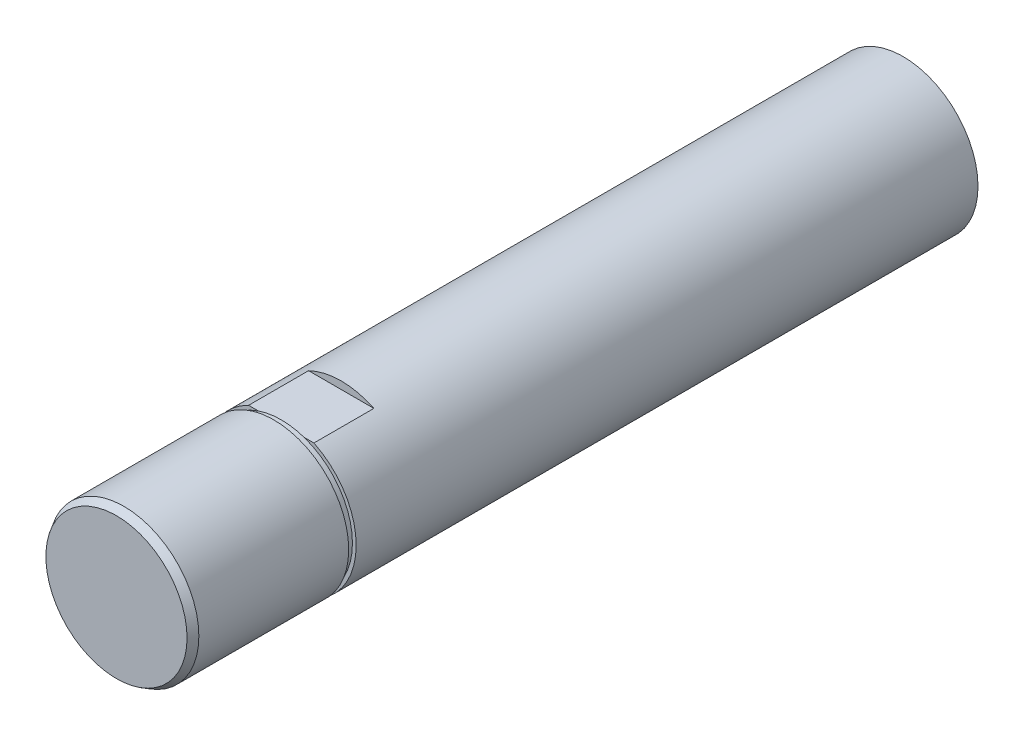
ISO-10303-21;
HEADER;
FILE_DESCRIPTION(('STEP AP214'),'2;1');
FILE_NAME('part.step','',(''),(''),'','','');
FILE_SCHEMA(('AUTOMOTIVE_DESIGN { 1 0 10303 214 1 1 1 1 }'));
ENDSEC;
DATA;
#1=APPLICATION_CONTEXT('core data for automotive mechanical design processes');
#2=APPLICATION_PROTOCOL_DEFINITION('international standard','automotive_design',2000,#1);
#3=PRODUCT_CONTEXT('',#1,'mechanical');
#4=PRODUCT('Part','Part','',(#3));
#5=PRODUCT_RELATED_PRODUCT_CATEGORY('part','',(#4));
#6=PRODUCT_DEFINITION_FORMATION('','',#4);
#7=PRODUCT_DEFINITION_CONTEXT('part definition',#1,'design');
#8=PRODUCT_DEFINITION('design','',#6,#7);
#9=PRODUCT_DEFINITION_SHAPE('','',#8);
#10=(LENGTH_UNIT() NAMED_UNIT(*) SI_UNIT(.MILLI.,.METRE.));
#11=(NAMED_UNIT(*) PLANE_ANGLE_UNIT() SI_UNIT($,.RADIAN.));
#12=(NAMED_UNIT(*) SI_UNIT($,.STERADIAN.) SOLID_ANGLE_UNIT());
#13=UNCERTAINTY_MEASURE_WITH_UNIT(LENGTH_MEASURE(1.E-05),#10,'distance_accuracy_value','');
#14=(GEOMETRIC_REPRESENTATION_CONTEXT(3) GLOBAL_UNCERTAINTY_ASSIGNED_CONTEXT((#13)) GLOBAL_UNIT_ASSIGNED_CONTEXT((#10,
#11,#12)) REPRESENTATION_CONTEXT('',''));
#15=CARTESIAN_POINT('',(0.,0.,0.));
#16=DIRECTION('',(0.,0.,1.));
#17=DIRECTION('',(1.,0.,0.));
#18=AXIS2_PLACEMENT_3D('',#15,#16,#17);
#19=CARTESIAN_POINT('',(0.,0.,8.));
#20=DIRECTION('',(0.,0.,1.));
#21=DIRECTION('',(1.,0.,0.));
#22=AXIS2_PLACEMENT_3D('',#19,#20,#21);
#23=PLANE('',#22);
#24=DIRECTION('',(1.,0.,0.));
#25=VECTOR('',#24,1.);
#26=CARTESIAN_POINT('',(-10.5,-9.,8.));
#27=LINE('',#26,#25);
#28=CARTESIAN_POINT('',(3.04138126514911,-9.,8.));
#29=VERTEX_POINT('',#28);
#30=CARTESIAN_POINT('',(4.35889894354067,-9.,7.99999999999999));
#31=VERTEX_POINT('',#30);
#32=EDGE_CURVE('E98',#29,#31,#27,.T.);
#33=ORIENTED_EDGE('',*,*,#32,.T.);
#34=CARTESIAN_POINT('',(0.,0.,8.));
#35=DIRECTION('',(0.,0.,1.));
#36=DIRECTION('',(1.,0.,0.));
#37=AXIS2_PLACEMENT_3D('',#34,#35,#36);
#38=CIRCLE('',#37,10.);
#39=CARTESIAN_POINT('',(4.35889894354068,9.,8.));
#40=VERTEX_POINT('',#39);
#41=EDGE_CURVE('E112',#31,#40,#38,.T.);
#42=ORIENTED_EDGE('',*,*,#41,.T.);
#43=DIRECTION('',(1.,0.,0.));
#44=VECTOR('',#43,1.);
#45=CARTESIAN_POINT('',(-10.5,9.,8.));
#46=LINE('',#45,#44);
#47=CARTESIAN_POINT('',(3.04138126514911,9.,8.));
#48=VERTEX_POINT('',#47);
#49=EDGE_CURVE('E146',#48,#40,#46,.T.);
#50=ORIENTED_EDGE('',*,*,#49,.F.);
#51=CARTESIAN_POINT('',(0.,0.,8.));
#52=DIRECTION('',(0.,0.,1.));
#53=DIRECTION('',(1.,0.,0.));
#54=AXIS2_PLACEMENT_3D('',#51,#52,#53);
#55=CIRCLE('',#54,9.5);
#56=EDGE_CURVE('E140',#29,#48,#55,.T.);
#57=ORIENTED_EDGE('',*,*,#56,.F.);
#58=EDGE_LOOP('',(#33,#42,#50,#57));
#59=FACE_BOUND('',#58,.T.);
#60=ADVANCED_FACE('F35',(#59),#23,.T.);
#61=CARTESIAN_POINT('',(0.,0.,-75.));
#62=DIRECTION('',(0.,0.,1.));
#63=DIRECTION('',(1.,0.,0.));
#64=AXIS2_PLACEMENT_3D('',#61,#62,#63);
#65=CYLINDRICAL_SURFACE('',#64,10.);
#66=CARTESIAN_POINT('',(0.,0.,9.));
#67=DIRECTION('',(0.,0.,1.));
#68=DIRECTION('',(1.,0.,0.));
#69=AXIS2_PLACEMENT_3D('',#66,#67,#68);
#70=CIRCLE('',#69,10.);
#71=CARTESIAN_POINT('',(10.,0.,9.));
#72=VERTEX_POINT('',#71);
#73=EDGE_CURVE('E111',#72,#72,#70,.T.);
#74=ORIENTED_EDGE('',*,*,#73,.T.);
#75=EDGE_LOOP('',(#74));
#76=FACE_BOUND('',#75,.T.);
#77=CARTESIAN_POINT('',(0.,0.,29.));
#78=DIRECTION('',(0.,0.,1.));
#79=DIRECTION('',(1.,0.,0.));
#80=AXIS2_PLACEMENT_3D('',#77,#78,#79);
#81=CIRCLE('',#80,10.);
#82=CARTESIAN_POINT('',(10.,0.,29.));
#83=VERTEX_POINT('',#82);
#84=EDGE_CURVE('E125',#83,#83,#81,.F.);
#85=ORIENTED_EDGE('',*,*,#84,.T.);
#86=EDGE_LOOP('',(#85));
#87=FACE_BOUND('',#86,.T.);
#88=ADVANCED_FACE('F176',(#76,#87),#65,.T.);
#89=CARTESIAN_POINT('',(0.,0.,30.));
#90=DIRECTION('',(0.,0.,1.));
#91=DIRECTION('',(1.,0.,0.));
#92=AXIS2_PLACEMENT_3D('',#89,#90,#91);
#93=PLANE('',#92);
#94=CARTESIAN_POINT('',(0.,0.,30.));
#95=DIRECTION('',(0.,0.,1.));
#96=DIRECTION('',(1.,0.,0.));
#97=AXIS2_PLACEMENT_3D('',#94,#95,#96);
#98=CIRCLE('',#97,9.42264973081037);
#99=CARTESIAN_POINT('',(9.42264973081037,0.,30.));
#100=VERTEX_POINT('',#99);
#101=EDGE_CURVE('E122',#100,#100,#98,.T.);
#102=ORIENTED_EDGE('',*,*,#101,.T.);
#103=EDGE_LOOP('',(#102));
#104=FACE_BOUND('',#103,.T.);
#105=ADVANCED_FACE('F181',(#104),#93,.T.);
#106=CARTESIAN_POINT('',(0.,0.,30.));
#107=DIRECTION('',(0.,0.,-1.));
#108=DIRECTION('',(-1.,0.,0.));
#109=AXIS2_PLACEMENT_3D('',#106,#107,#108);
#110=CONICAL_SURFACE('',#109,9.42264973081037,0.523598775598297);
#111=ORIENTED_EDGE('',*,*,#84,.F.);
#112=EDGE_LOOP('',(#111));
#113=FACE_BOUND('',#112,.T.);
#114=ORIENTED_EDGE('',*,*,#101,.F.);
#115=EDGE_LOOP('',(#114));
#116=FACE_BOUND('',#115,.T.);
#117=ADVANCED_FACE('F37',(#113,#116),#110,.T.);
#118=CARTESIAN_POINT('',(0.,0.,9.));
#119=DIRECTION('',(0.,0.,1.));
#120=DIRECTION('',(1.,0.,0.));
#121=AXIS2_PLACEMENT_3D('',#118,#119,#120);
#122=PLANE('',#121);
#123=ORIENTED_EDGE('',*,*,#73,.F.);
#124=EDGE_LOOP('',(#123));
#125=FACE_BOUND('',#124,.T.);
#126=CARTESIAN_POINT('',(0.,0.,9.));
#127=DIRECTION('',(0.,0.,1.));
#128=DIRECTION('',(1.,0.,0.));
#129=AXIS2_PLACEMENT_3D('',#126,#127,#128);
#130=CIRCLE('',#129,9.5);
#131=CARTESIAN_POINT('',(9.5,0.,9.));
#132=VERTEX_POINT('',#131);
#133=EDGE_CURVE('E117',#132,#132,#130,.T.);
#134=ORIENTED_EDGE('',*,*,#133,.T.);
#135=EDGE_LOOP('',(#134));
#136=FACE_BOUND('',#135,.T.);
#137=ADVANCED_FACE('F186',(#125,#136),#122,.F.);
#138=CARTESIAN_POINT('',(-4.35889894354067,-9.,7.99999999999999));
#139=VERTEX_POINT('',#138);
#140=CARTESIAN_POINT('',(-3.04138126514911,-9.,8.));
#141=VERTEX_POINT('',#140);
#142=EDGE_CURVE('E87',#139,#141,#27,.T.);
#143=ORIENTED_EDGE('',*,*,#142,.T.);
#144=CARTESIAN_POINT('',(-3.04138126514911,9.,8.));
#145=VERTEX_POINT('',#144);
#146=EDGE_CURVE('E150',#145,#141,#55,.T.);
#147=ORIENTED_EDGE('',*,*,#146,.F.);
#148=CARTESIAN_POINT('',(-4.35889894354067,9.,8.));
#149=VERTEX_POINT('',#148);
#150=EDGE_CURVE('E110',#149,#145,#46,.T.);
#151=ORIENTED_EDGE('',*,*,#150,.F.);
#152=EDGE_CURVE('E104',#149,#139,#38,.T.);
#153=ORIENTED_EDGE('',*,*,#152,.T.);
#154=EDGE_LOOP('',(#143,#147,#151,#153));
#155=FACE_BOUND('',#154,.T.);
#156=ADVANCED_FACE('F108',(#155),#23,.T.);
#157=CARTESIAN_POINT('',(0.,0.,9.));
#158=DIRECTION('',(0.,0.,-1.));
#159=DIRECTION('',(-1.,0.,0.));
#160=AXIS2_PLACEMENT_3D('',#157,#158,#159);
#161=CYLINDRICAL_SURFACE('',#160,9.5);
#162=ORIENTED_EDGE('',*,*,#133,.F.);
#163=EDGE_LOOP('',(#162));
#164=FACE_BOUND('',#163,.T.);
#165=EDGE_CURVE('E151',#48,#145,#55,.T.);
#166=ORIENTED_EDGE('',*,*,#165,.T.);
#167=ORIENTED_EDGE('',*,*,#146,.T.);
#168=CARTESIAN_POINT('',(0.,0.,8.));
#169=DIRECTION('',(0.,0.,1.));
#170=DIRECTION('',(1.,0.,0.));
#171=AXIS2_PLACEMENT_3D('',#168,#169,#170);
#172=CIRCLE('',#171,9.5);
#173=EDGE_CURVE('E155',#141,#29,#172,.T.);
#174=ORIENTED_EDGE('',*,*,#173,.T.);
#175=ORIENTED_EDGE('',*,*,#56,.T.);
#176=EDGE_LOOP('',(#166,#167,#174,#175));
#177=FACE_BOUND('',#176,.T.);
#178=ADVANCED_FACE('F161',(#164,#177),#161,.T.);
#179=CARTESIAN_POINT('',(0.,0.,-75.));
#180=DIRECTION('',(0.,0.,1.));
#181=DIRECTION('',(1.,0.,0.));
#182=AXIS2_PLACEMENT_3D('',#179,#180,#181);
#183=PLANE('',#182);
#184=CARTESIAN_POINT('',(0.,0.,-75.));
#185=DIRECTION('',(0.,0.,1.));
#186=DIRECTION('',(1.,0.,0.));
#187=AXIS2_PLACEMENT_3D('',#184,#185,#186);
#188=CIRCLE('',#187,10.);
#189=CARTESIAN_POINT('',(10.,0.,-75.));
#190=VERTEX_POINT('',#189);
#191=EDGE_CURVE('E115',#190,#190,#188,.T.);
#192=ORIENTED_EDGE('',*,*,#191,.F.);
#193=EDGE_LOOP('',(#192));
#194=FACE_BOUND('',#193,.T.);
#195=ADVANCED_FACE('F191',(#194),#183,.F.);
#196=DIRECTION('',(0.,0.,1.));
#197=VECTOR('',#196,1.);
#198=CARTESIAN_POINT('',(-4.35889894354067,-9.,-75.));
#199=LINE('',#198,#197);
#200=CARTESIAN_POINT('',(-4.35889894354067,-9.,0.));
#201=VERTEX_POINT('',#200);
#202=EDGE_CURVE('E11',#139,#201,#199,.F.);
#203=ORIENTED_EDGE('',*,*,#202,.F.);
#204=ORIENTED_EDGE('',*,*,#152,.F.);
#205=DIRECTION('',(0.,0.,1.));
#206=VECTOR('',#205,1.);
#207=CARTESIAN_POINT('',(-4.35889894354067,9.,-75.));
#208=LINE('',#207,#206);
#209=CARTESIAN_POINT('',(-4.35889894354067,9.,0.));
#210=VERTEX_POINT('',#209);
#211=EDGE_CURVE('E128',#210,#149,#208,.T.);
#212=ORIENTED_EDGE('',*,*,#211,.F.);
#213=CARTESIAN_POINT('',(0.,0.,0.));
#214=DIRECTION('',(0.,0.,-1.));
#215=DIRECTION('',(-1.,0.,0.));
#216=AXIS2_PLACEMENT_3D('',#213,#214,#215);
#217=CIRCLE('',#216,10.);
#218=CARTESIAN_POINT('',(4.35889894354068,9.,0.));
#219=VERTEX_POINT('',#218);
#220=EDGE_CURVE('E130',#219,#210,#217,.F.);
#221=ORIENTED_EDGE('',*,*,#220,.F.);
#222=DIRECTION('',(0.,0.,1.));
#223=VECTOR('',#222,1.);
#224=CARTESIAN_POINT('',(4.35889894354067,9.,-75.));
#225=LINE('',#224,#223);
#226=EDGE_CURVE('E132',#40,#219,#225,.F.);
#227=ORIENTED_EDGE('',*,*,#226,.F.);
#228=ORIENTED_EDGE('',*,*,#41,.F.);
#229=DIRECTION('',(0.,0.,1.));
#230=VECTOR('',#229,1.);
#231=CARTESIAN_POINT('',(4.35889894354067,-9.,-75.));
#232=LINE('',#231,#230);
#233=CARTESIAN_POINT('',(4.35889894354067,-9.,0.));
#234=VERTEX_POINT('',#233);
#235=EDGE_CURVE('E43',#234,#31,#232,.T.);
#236=ORIENTED_EDGE('',*,*,#235,.F.);
#237=CARTESIAN_POINT('',(0.,0.,0.));
#238=DIRECTION('',(0.,0.,-1.));
#239=DIRECTION('',(-1.,0.,0.));
#240=AXIS2_PLACEMENT_3D('',#237,#238,#239);
#241=CIRCLE('',#240,10.);
#242=EDGE_CURVE('E106',#201,#234,#241,.F.);
#243=ORIENTED_EDGE('',*,*,#242,.F.);
#244=EDGE_LOOP('',(#203,#204,#212,#221,#227,#228,#236,#243));
#245=FACE_BOUND('',#244,.T.);
#246=ORIENTED_EDGE('',*,*,#191,.T.);
#247=EDGE_LOOP('',(#246));
#248=FACE_BOUND('',#247,.T.);
#249=ADVANCED_FACE('F101',(#245,#248),#65,.T.);
#250=CARTESIAN_POINT('',(-10.5,10.5,8.));
#251=DIRECTION('',(0.,0.,1.));
#252=DIRECTION('',(1.,0.,0.));
#253=AXIS2_PLACEMENT_3D('',#250,#251,#252);
#254=PLANE('',#253);
#255=EDGE_CURVE('E152',#145,#48,#46,.T.);
#256=ORIENTED_EDGE('',*,*,#255,.F.);
#257=ORIENTED_EDGE('',*,*,#165,.F.);
#258=EDGE_LOOP('',(#256,#257));
#259=FACE_BOUND('',#258,.T.);
#260=ADVANCED_FACE('F202',(#259),#254,.F.);
#261=CARTESIAN_POINT('',(-10.5,10.5,0.));
#262=DIRECTION('',(0.,0.,-1.));
#263=DIRECTION('',(-1.,0.,0.));
#264=AXIS2_PLACEMENT_3D('',#261,#262,#263);
#265=PLANE('',#264);
#266=ORIENTED_EDGE('',*,*,#220,.T.);
#267=DIRECTION('',(1.,0.,0.));
#268=VECTOR('',#267,1.);
#269=CARTESIAN_POINT('',(-10.5,9.,0.));
#270=LINE('',#269,#268);
#271=EDGE_CURVE('E56',#210,#219,#270,.T.);
#272=ORIENTED_EDGE('',*,*,#271,.T.);
#273=EDGE_LOOP('',(#266,#272));
#274=FACE_BOUND('',#273,.T.);
#275=ADVANCED_FACE('F148',(#274),#265,.F.);
#276=CARTESIAN_POINT('',(-10.5,9.,8.));
#277=DIRECTION('',(0.,-1.,0.));
#278=DIRECTION('',(0.,0.,-1.));
#279=AXIS2_PLACEMENT_3D('',#276,#277,#278);
#280=PLANE('',#279);
#281=ORIENTED_EDGE('',*,*,#226,.T.);
#282=ORIENTED_EDGE('',*,*,#271,.F.);
#283=ORIENTED_EDGE('',*,*,#211,.T.);
#284=ORIENTED_EDGE('',*,*,#150,.T.);
#285=ORIENTED_EDGE('',*,*,#255,.T.);
#286=ORIENTED_EDGE('',*,*,#49,.T.);
#287=EDGE_LOOP('',(#281,#282,#283,#284,#285,#286));
#288=FACE_BOUND('',#287,.T.);
#289=ADVANCED_FACE('F144',(#288),#280,.F.);
#290=CARTESIAN_POINT('',(-10.5,-9.,8.));
#291=DIRECTION('',(0.,0.,1.));
#292=DIRECTION('',(1.,0.,0.));
#293=AXIS2_PLACEMENT_3D('',#290,#291,#292);
#294=PLANE('',#293);
#295=EDGE_CURVE('E92',#141,#29,#27,.T.);
#296=ORIENTED_EDGE('',*,*,#295,.T.);
#297=ORIENTED_EDGE('',*,*,#173,.F.);
#298=EDGE_LOOP('',(#296,#297));
#299=FACE_BOUND('',#298,.T.);
#300=ADVANCED_FACE('F164',(#299),#294,.F.);
#301=CARTESIAN_POINT('',(-10.5,-9.,8.));
#302=DIRECTION('',(0.,1.,0.));
#303=DIRECTION('',(0.,0.,1.));
#304=AXIS2_PLACEMENT_3D('',#301,#302,#303);
#305=PLANE('',#304);
#306=ORIENTED_EDGE('',*,*,#202,.T.);
#307=DIRECTION('',(1.,0.,0.));
#308=VECTOR('',#307,1.);
#309=CARTESIAN_POINT('',(-10.5,-9.,0.));
#310=LINE('',#309,#308);
#311=EDGE_CURVE('E49',#201,#234,#310,.T.);
#312=ORIENTED_EDGE('',*,*,#311,.T.);
#313=ORIENTED_EDGE('',*,*,#235,.T.);
#314=ORIENTED_EDGE('',*,*,#32,.F.);
#315=ORIENTED_EDGE('',*,*,#295,.F.);
#316=ORIENTED_EDGE('',*,*,#142,.F.);
#317=EDGE_LOOP('',(#306,#312,#313,#314,#315,#316));
#318=FACE_BOUND('',#317,.T.);
#319=ADVANCED_FACE('F89',(#318),#305,.F.);
#320=CARTESIAN_POINT('',(-10.5,-9.,0.));
#321=DIRECTION('',(0.,0.,-1.));
#322=DIRECTION('',(-1.,0.,0.));
#323=AXIS2_PLACEMENT_3D('',#320,#321,#322);
#324=PLANE('',#323);
#325=ORIENTED_EDGE('',*,*,#242,.T.);
#326=ORIENTED_EDGE('',*,*,#311,.F.);
#327=EDGE_LOOP('',(#325,#326));
#328=FACE_BOUND('',#327,.T.);
#329=ADVANCED_FACE('F171',(#328),#324,.F.);
#330=CLOSED_SHELL('',(#60,#88,#105,#117,#137,#156,#178,#195,#249,#260,#275,#289,#300,#319,#329));
#331=MANIFOLD_SOLID_BREP('B2',#330);
#332=ADVANCED_BREP_SHAPE_REPRESENTATION('',(#18,#331),#14);
#333=SHAPE_DEFINITION_REPRESENTATION(#9,#332);
ENDSEC;
END-ISO-10303-21;
